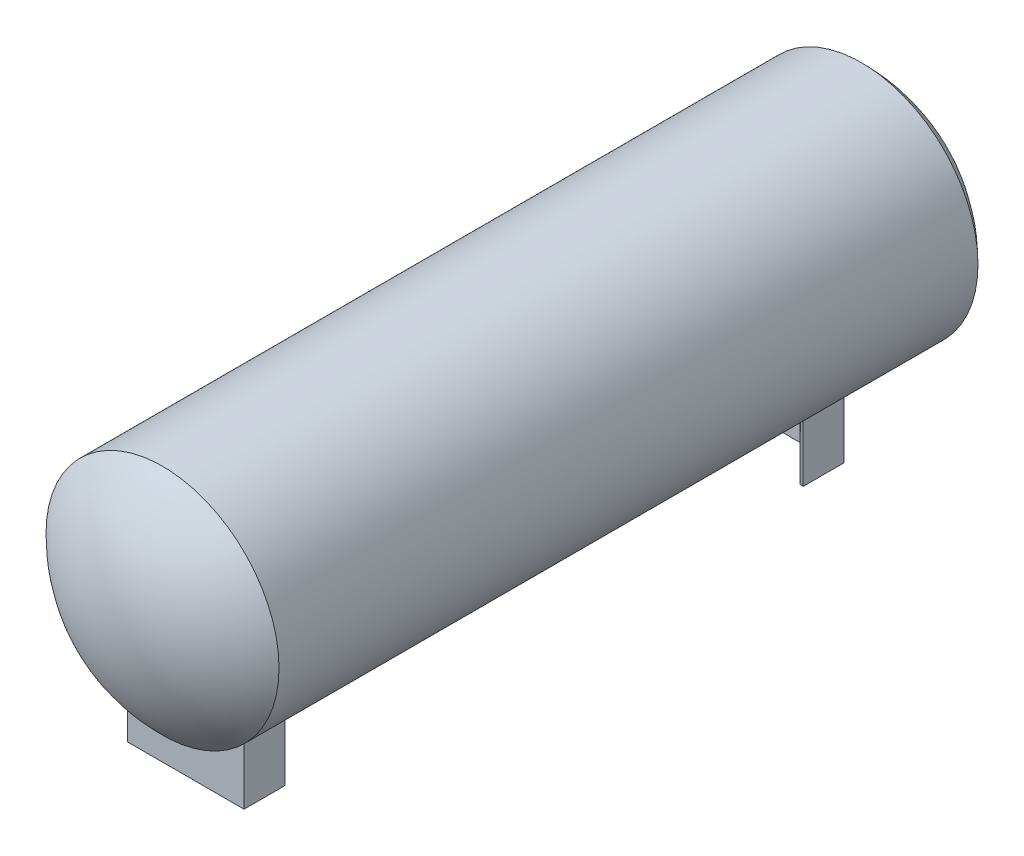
from build123d import *

# Parameters (mm, degrees)
BOSS_EXTRUDE1_DEPTH = 177.8


with BuildPart() as part:
    # Sketch1 → Revolve1 (revolve)
    with BuildSketch(Plane(origin=(0, 0, 0), x_dir=(1, 0, 0), z_dir=(0, 1, 0))):
        with BuildLine():
            Line((-127, 381), (-127, -381))
            ThreePointArc((-127, -381), (-68.87837384, -420.482392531), (0, -434.365921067))
            Line((0, -434.365921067), (0, 434.365921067))
            ThreePointArc((0, 434.365921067), (-68.87837384, 420.482392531), (-127, 381))
        make_face()
    revolve(axis=Axis((0, 0, -434.365921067), (0, 0, 1)))

    # Sketch5 → Boss-Extrude1 (add)
    with BuildSketch(Plane(origin=(85.725, 0, -41.275), x_dir=(0, 0, -1), z_dir=(0, 1, 0))):
        with BuildLine():
            Line((-396.875, 22.225), (-396.875, 149.225))
            Line((-396.875, 149.225), (-352.425, 149.225))
            Line((-352.425, 149.225), (-352.425, 146.76608558))
            ThreePointArc((-352.425, 146.76608558), (-353.087111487, 144.96012673), (-354.759636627, 144.010106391))
            Line((-354.759636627, 144.010106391), (-385.894048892, 138.820659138))
            ThreePointArc((-385.894048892, 138.820659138), (-390.303433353, 136.316060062), (-392.049, 131.554895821))
            Line((-392.049, 131.554895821), (-392.049, 39.895104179))
            ThreePointArc((-392.049, 39.895104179), (-390.303433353, 35.133939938), (-385.894048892, 32.629340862))
            Line((-385.894048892, 32.629340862), (-354.759636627, 27.439893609))
            ThreePointArc((-354.759636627, 27.439893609), (-353.087111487, 26.48987327), (-352.425, 24.68391442))
            Line((-352.425, 24.68391442), (-352.425, 22.225))
            Line((-352.425, 22.225), (-396.875, 22.225))
        make_face()
        with BuildLine():
            Line((246.194048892, 32.629340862), (215.059636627, 27.439893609))
            ThreePointArc((215.059636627, 27.439893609), (213.387111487, 26.48987327), (212.725, 24.68391442))
            Line((212.725, 24.68391442), (212.725, 22.225))
            Line((212.725, 22.225), (257.175, 22.225))
            Line((257.175, 22.225), (257.175, 149.225))
            Line((257.175, 149.225), (212.725, 149.225))
            Line((212.725, 149.225), (212.725, 146.76608558))
            ThreePointArc((212.725, 146.76608558), (213.387111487, 144.96012673), (215.059636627, 144.010106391))
            Line((215.059636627, 144.010106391), (246.194048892, 138.820659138))
            ThreePointArc((246.194048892, 138.820659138), (250.603433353, 136.316060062), (252.349, 131.554895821))
            Line((252.349, 131.554895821), (252.349, 39.895104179))
            ThreePointArc((252.349, 39.895104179), (250.603433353, 35.133939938), (246.194048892, 32.629340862))
        make_face()
    extrude(amount=-BOSS_EXTRUDE1_DEPTH)


solid = part.part
